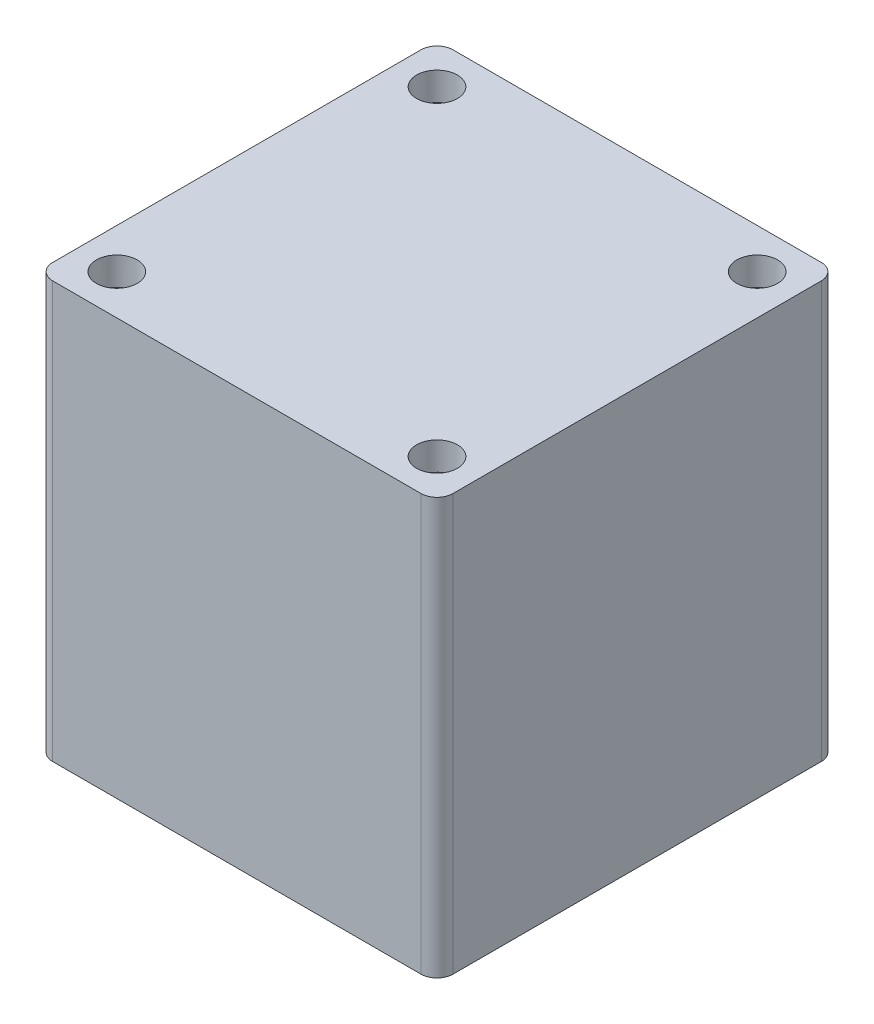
from build123d import *

# Parameters (mm, degrees)
SKETCH2_R           = 2.55
BOSS_EXTRUDE2_DEPTH = 8
SKETCH5_R           = 3
BOSS_EXTRUDE3_DEPTH = 4.5
BOSS_EXTRUDE4_START = 42
BOSS_EXTRUDE4_DEPTH = 42
BOSS_EXTRUDE5_DEPTH = 42
BOSS_EXTRUDE6_START = 2
BOSS_EXTRUDE6_DEPTH = 2


with BuildPart() as part:
    # Sketch2 → Boss-Extrude2 (new body)
    # profile 1 of 4: a face of its own
    with BuildSketch(Plane(origin=(0, 0, 0), x_dir=(1, 0, 0), z_dir=(0, 1, 0))):
        with BuildLine():
            Line((-23, -25), (23, -25))
            ThreePointArc((23, -25), (24.414213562, -24.414213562), (25, -23))
            Line((25, -23), (25, 23))
            ThreePointArc((25, 23), (24.414213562, 24.414213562), (23, 25))
            Line((23, 25), (5, 25))
            Line((5, 25), (-5, 25))
            Line((-5, 25), (-23, 25))
            ThreePointArc((-23, 25), (-24.414213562, 24.414213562), (-25, 23))
            Line((-25, 23), (-25, 5))
            Line((-25, 5), (-25, -5))
            Line((-25, -5), (-25, -23))
            ThreePointArc((-25, -23), (-24.414213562, -24.414213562), (-23, -25))
        make_face()
        with Locations(Location((-20, -20, 0), (0, 0, 270))):
            Circle(SKETCH2_R, mode=Mode.SUBTRACT)
        with Locations(Location((20, -20, 0), (0, 0, 270))):
            Circle(SKETCH2_R, mode=Mode.SUBTRACT)
        with BuildLine():
            ThreePointArc((17, -15.217914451), (16.414213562, -16.632128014), (15, -17.217914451))
            Line((15, -17.217914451), (1.25, -17.217914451))
            Line((1.25, -17.217914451), (-1.25, -17.217914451))
            Line((-1.25, -17.217914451), (-15, -17.217914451))
            ThreePointArc((-15, -17.217914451), (-16.414213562, -16.632128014), (-17, -15.217914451))
            Line((-17, -15.217914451), (-17, 15.217914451))
            ThreePointArc((-17, 15.217914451), (-16.414213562, 16.632128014), (-15, 17.217914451))
            Line((-15, 17.217914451), (15, 17.217914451))
            ThreePointArc((15, 17.217914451), (16.414213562, 16.632128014), (17, 15.217914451))
            Line((17, 15.217914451), (17, 1.25))
            Line((17, 1.25), (17, -1.25))
            Line((17, -1.25), (17, -15.217914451))
        make_face(mode=Mode.SUBTRACT)
        with Locations(Location((-20, 20, 0), (0, 0, 270))):
            Circle(SKETCH2_R, mode=Mode.SUBTRACT)
        with Locations(Location((20, 20, 0), (0, 0, 270))):
            Circle(SKETCH2_R, mode=Mode.SUBTRACT)
    # profile 2 of 4: a face of its own
    with BuildSketch(Plane(origin=(0, 0, 0), x_dir=(1, 0, 0), z_dir=(0, 1, 0))):
        with BuildLine():
            Line((-23, -25), (23, -25))
            ThreePointArc((23, -25), (24.414213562, -24.414213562), (25, -23))
            Line((25, -23), (25, 23))
            ThreePointArc((25, 23), (24.414213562, 24.414213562), (23, 25))
            Line((23, 25), (5, 25))
            Line((5, 25), (-5, 25))
            Line((-5, 25), (-23, 25))
            ThreePointArc((-23, 25), (-24.414213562, 24.414213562), (-25, 23))
            Line((-25, 23), (-25, 5))
            Line((-25, 5), (-25, -5))
            Line((-25, -5), (-25, -23))
            ThreePointArc((-25, -23), (-24.414213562, -24.414213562), (-23, -25))
        make_face()
        with Locations(Location((-20, -20, 0), (0, 0, 270))):
            Circle(SKETCH2_R, mode=Mode.SUBTRACT)
        with Locations(Location((20, -20, 0), (0, 0, 270))):
            Circle(SKETCH2_R, mode=Mode.SUBTRACT)
        with BuildLine():
            ThreePointArc((17, -15.217914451), (16.414213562, -16.632128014), (15, -17.217914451))
            Line((15, -17.217914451), (1.25, -17.217914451))
            Line((1.25, -17.217914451), (-1.25, -17.217914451))
            Line((-1.25, -17.217914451), (-15, -17.217914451))
            ThreePointArc((-15, -17.217914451), (-16.414213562, -16.632128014), (-17, -15.217914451))
            Line((-17, -15.217914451), (-17, 15.217914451))
            ThreePointArc((-17, 15.217914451), (-16.414213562, 16.632128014), (-15, 17.217914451))
            Line((-15, 17.217914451), (15, 17.217914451))
            ThreePointArc((15, 17.217914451), (16.414213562, 16.632128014), (17, 15.217914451))
            Line((17, 15.217914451), (17, 1.25))
            Line((17, 1.25), (17, -1.25))
            Line((17, -1.25), (17, -15.217914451))
        make_face(mode=Mode.SUBTRACT)
        with Locations(Location((-20, 20, 0), (0, 0, 270))):
            Circle(SKETCH2_R, mode=Mode.SUBTRACT)
        with Locations(Location((20, 20, 0), (0, 0, 270))):
            Circle(SKETCH2_R, mode=Mode.SUBTRACT)
    # profile 3 of 4: a face of its own
    with BuildSketch(Plane(origin=(0, 0, 0), x_dir=(1, 0, 0), z_dir=(0, 1, 0))):
        with BuildLine():
            Line((-23, -25), (23, -25))
            ThreePointArc((23, -25), (24.414213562, -24.414213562), (25, -23))
            Line((25, -23), (25, 23))
            ThreePointArc((25, 23), (24.414213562, 24.414213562), (23, 25))
            Line((23, 25), (5, 25))
            Line((5, 25), (-5, 25))
            Line((-5, 25), (-23, 25))
            ThreePointArc((-23, 25), (-24.414213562, 24.414213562), (-25, 23))
            Line((-25, 23), (-25, 5))
            Line((-25, 5), (-25, -5))
            Line((-25, -5), (-25, -23))
            ThreePointArc((-25, -23), (-24.414213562, -24.414213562), (-23, -25))
        make_face()
        with Locations(Location((-20, -20, 0), (0, 0, 270))):
            Circle(SKETCH2_R, mode=Mode.SUBTRACT)
        with Locations(Location((20, -20, 0), (0, 0, 270))):
            Circle(SKETCH2_R, mode=Mode.SUBTRACT)
        with BuildLine():
            ThreePointArc((17, -15.217914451), (16.414213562, -16.632128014), (15, -17.217914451))
            Line((15, -17.217914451), (1.25, -17.217914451))
            Line((1.25, -17.217914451), (-1.25, -17.217914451))
            Line((-1.25, -17.217914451), (-15, -17.217914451))
            ThreePointArc((-15, -17.217914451), (-16.414213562, -16.632128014), (-17, -15.217914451))
            Line((-17, -15.217914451), (-17, 15.217914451))
            ThreePointArc((-17, 15.217914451), (-16.414213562, 16.632128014), (-15, 17.217914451))
            Line((-15, 17.217914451), (15, 17.217914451))
            ThreePointArc((15, 17.217914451), (16.414213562, 16.632128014), (17, 15.217914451))
            Line((17, 15.217914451), (17, 1.25))
            Line((17, 1.25), (17, -1.25))
            Line((17, -1.25), (17, -15.217914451))
        make_face(mode=Mode.SUBTRACT)
        with Locations(Location((-20, 20, 0), (0, 0, 270))):
            Circle(SKETCH2_R, mode=Mode.SUBTRACT)
        with Locations(Location((20, 20, 0), (0, 0, 270))):
            Circle(SKETCH2_R, mode=Mode.SUBTRACT)
    # profile 4 of 4: a face of its own
    with BuildSketch(Plane(origin=(0, 0, 0), x_dir=(1, 0, 0), z_dir=(0, 1, 0))):
        with BuildLine():
            Line((15, 17.217914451), (-15, 17.217914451))
            ThreePointArc((-15, 17.217914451), (-16.414213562, 16.632128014), (-17, 15.217914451))
            Line((-17, 15.217914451), (-17, -15.217914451))
            ThreePointArc((-17, -15.217914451), (-16.414213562, -16.632128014), (-15, -17.217914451))
            Line((-15, -17.217914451), (-1.25, -17.217914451))
            Line((-1.25, -17.217914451), (1.25, -17.217914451))
            Line((1.25, -17.217914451), (15, -17.217914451))
            ThreePointArc((15, -17.217914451), (16.414213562, -16.632128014), (17, -15.217914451))
            Line((17, -15.217914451), (17, -1.25))
            Line((17, -1.25), (17, 1.25))
            Line((17, 1.25), (17, 15.217914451))
            ThreePointArc((17, 15.217914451), (16.414213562, 16.632128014), (15, 17.217914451))
        make_face()
    extrude(amount=BOSS_EXTRUDE2_DEPTH)

    # Sketch5 → Boss-Extrude3 (add)
    with BuildSketch(Plane.XZ):
        with Locations((-20, 20)):
            Circle(SKETCH5_R)
        with Locations((20, 20)):
            Circle(SKETCH5_R)
        with Locations((20, -20)):
            Circle(SKETCH5_R)
        with Locations((-20, -20)):
            Circle(SKETCH5_R)
    extrude(amount=-BOSS_EXTRUDE3_DEPTH)

    # Sketch6 → Boss-Extrude4 (add)
    with BuildSketch(Plane.XZ.offset(BOSS_EXTRUDE4_START)):
        with BuildLine():
            Line((-23, -25), (23, -25))
            ThreePointArc((23, -25), (24.414213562, -24.414213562), (25, -23))
            Line((25, -23), (25, 23))
            ThreePointArc((25, 23), (24.414213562, 24.414213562), (23, 25))
            Line((23, 25), (-23, 25))
            ThreePointArc((-23, 25), (-24.414213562, 24.414213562), (-25, 23))
            Line((-25, 23), (-25, 22))
            Line((-25, 22), (-22, 22))
            Line((-22, 22), (22, 22))
            Line((22, 22), (22, -22))
            Line((22, -22), (-22, -22))
            Line((-22, -22), (-25, -22))
            Line((-25, -22), (-25, -23))
            ThreePointArc((-25, -23), (-24.414213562, -24.414213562), (-23, -25))
        make_face()
    extrude(amount=-BOSS_EXTRUDE4_DEPTH)

    # Sketch7 → Boss-Extrude5 (add)
    with BuildSketch(Plane.XZ):
        Polygon((-10.106601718, -7.150757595), (-25, -7.150757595), (-25, -22), (-22, -22), (-22, -9.272077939), (-12.227922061, -9.272077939), align=None)
        Polygon((4.742640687, -22), (-10.106601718, -7.150757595), (-12.227922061, -9.272077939), (0.5, -22), align=None)
        Polygon((-20.757359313, 22), (-25, 22), (3.284271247, -6.284271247), (5.405591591, -4.162950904), align=None)
        Polygon((-0.5, 22), (-4.742640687, 22), (22, -4.742640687), (22, -0.5), align=None)
        Polygon((22, -8.985281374), (22, -4.742640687), (19.591883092, -7.150757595), (4.742640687, -22), (8.985281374, -22), (21.713203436, -9.272077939), align=None)
    extrude(amount=BOSS_EXTRUDE5_DEPTH)

    # Sketch9 → Boss-Extrude6 (add)
    with BuildSketch(Plane.XZ.offset(42).offset(BOSS_EXTRUDE6_START)):
        with BuildLine():
            Line((-23, -25), (23, -25))
            ThreePointArc((23, -25), (24.414213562, -24.414213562), (25, -23))
            Line((25, -23), (25, 23))
            ThreePointArc((25, 23), (24.414213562, 24.414213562), (23, 25))
            Line((23, 25), (-23, 25))
            ThreePointArc((-23, 25), (-24.414213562, 24.414213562), (-25, 23))
            Line((-25, 23), (-25, -23))
            ThreePointArc((-25, -23), (-24.414213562, -24.414213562), (-23, -25))
        make_face()
    extrude(amount=-BOSS_EXTRUDE6_DEPTH)


solid = part.part
